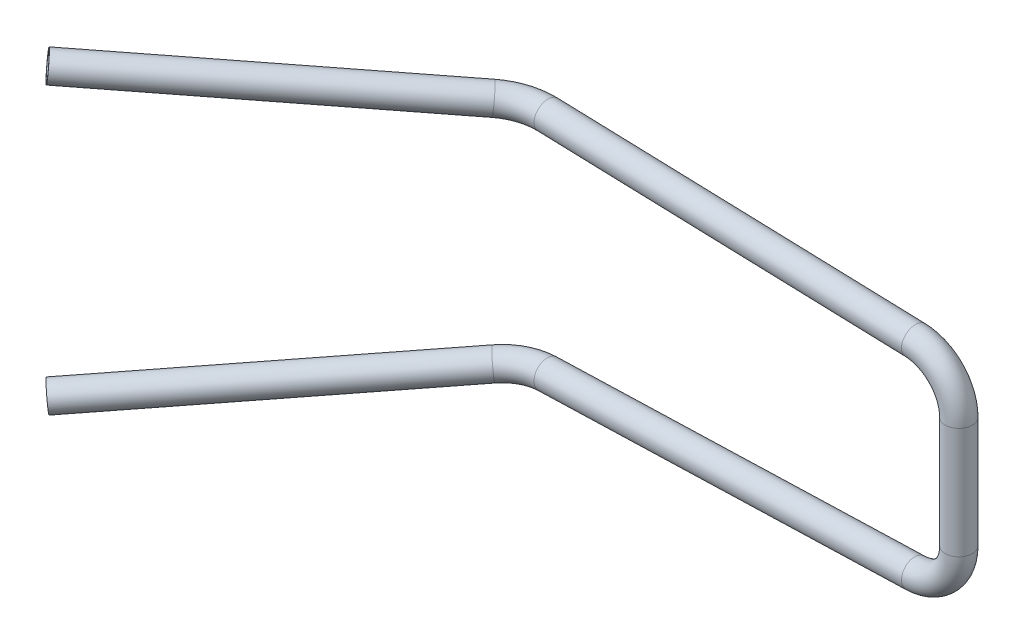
from build123d import *

# Parameters (mm, degrees)
ESQUISSE5_R   = 15
ESQUISSE5_R_2 = 13


with BuildPart() as part:
    # Balayage1: sweep along a curve in space
    with BuildLine() as balayage1_path:
        Line((-743.931212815, -158.089879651, 263.884705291), (-497.278865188, -127.193748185, 17.49467207))
        ThreePointArc((-454.926313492, -124.22339401, 0), (-477.861621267, -125.368301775, 4.546698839), (-497.278865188, -127.193748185, 17.49467207))
        Line((-454.926313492, -124.22339401, 0), (-48.4375, -111.514411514, 0))
        ThreePointArc((-48.4375, -111.514411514, 0), (-14.096483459, -96.337358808, 0), (0, -61.53883154, 0))
        Line((0, 0, 0), (0, -61.53883154, 0))
    # Esquisse5 → Balayage1 (sweep)
    with BuildSketch(Plane(origin=(0, 0, 0), x_dir=(1, 0, 0), z_dir=(0, 1, 0))):
        Circle(ESQUISSE5_R)
        Circle(ESQUISSE5_R_2, mode=Mode.SUBTRACT)
    balayage1 = sweep(path=balayage1_path.line)

    # Sym_trie1: Balayage1 across plane
    add(balayage1.mirror(Plane.ZX))


solid = part.part
